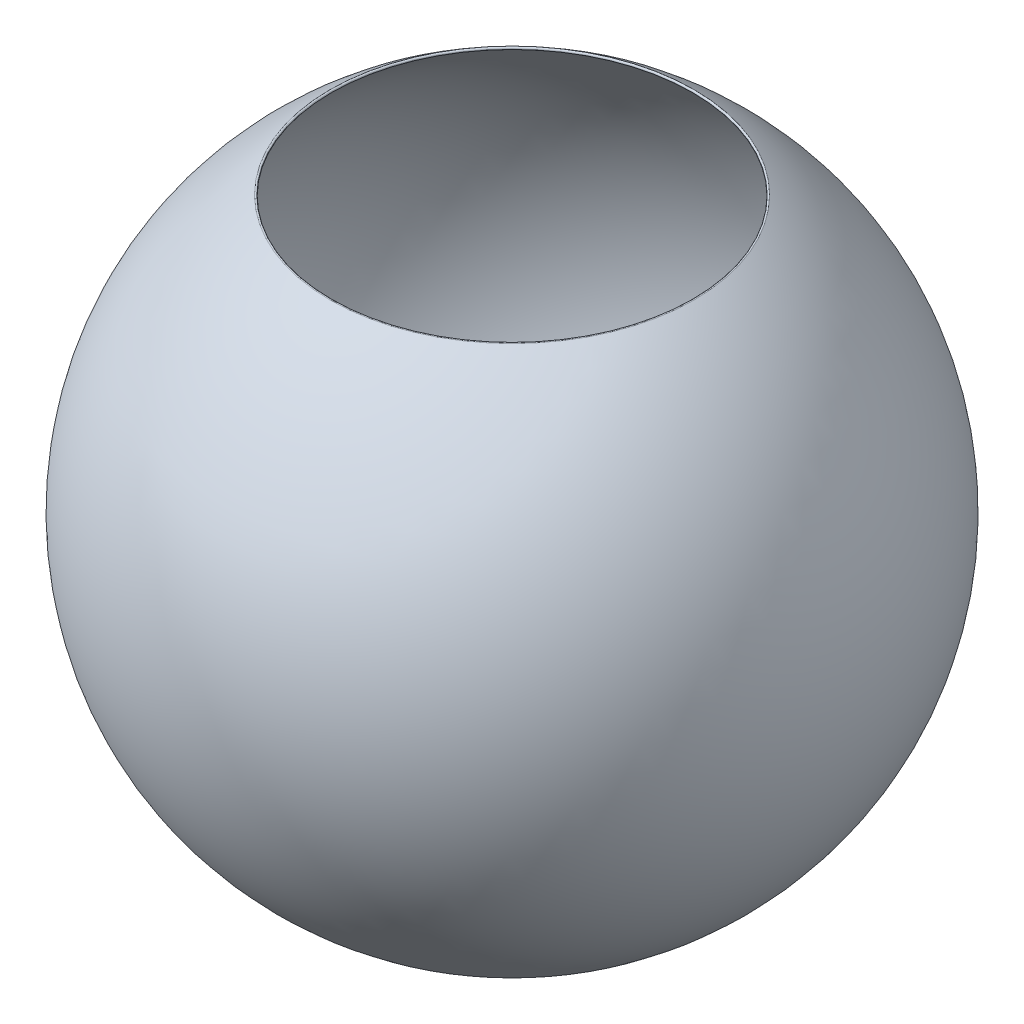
ISO-10303-21;
HEADER;
FILE_DESCRIPTION(('STEP AP214'),'2;1');
FILE_NAME('part.step','',(''),(''),'','','');
FILE_SCHEMA(('AUTOMOTIVE_DESIGN { 1 0 10303 214 1 1 1 1 }'));
ENDSEC;
DATA;
#1=APPLICATION_CONTEXT('core data for automotive mechanical design processes');
#2=APPLICATION_PROTOCOL_DEFINITION('international standard','automotive_design',2000,#1);
#3=PRODUCT_CONTEXT('',#1,'mechanical');
#4=PRODUCT('Part','Part','',(#3));
#5=PRODUCT_RELATED_PRODUCT_CATEGORY('part','',(#4));
#6=PRODUCT_DEFINITION_FORMATION('','',#4);
#7=PRODUCT_DEFINITION_CONTEXT('part definition',#1,'design');
#8=PRODUCT_DEFINITION('design','',#6,#7);
#9=PRODUCT_DEFINITION_SHAPE('','',#8);
#10=(LENGTH_UNIT() NAMED_UNIT(*) SI_UNIT(.MILLI.,.METRE.));
#11=(NAMED_UNIT(*) PLANE_ANGLE_UNIT() SI_UNIT($,.RADIAN.));
#12=(NAMED_UNIT(*) SI_UNIT($,.STERADIAN.) SOLID_ANGLE_UNIT());
#13=UNCERTAINTY_MEASURE_WITH_UNIT(LENGTH_MEASURE(1.E-05),#10,'distance_accuracy_value','');
#14=(GEOMETRIC_REPRESENTATION_CONTEXT(3) GLOBAL_UNCERTAINTY_ASSIGNED_CONTEXT((#13)) GLOBAL_UNIT_ASSIGNED_CONTEXT((#10,
#11,#12)) REPRESENTATION_CONTEXT('',''));
#15=CARTESIAN_POINT('',(0.,0.,0.));
#16=DIRECTION('',(0.,0.,1.));
#17=DIRECTION('',(1.,0.,0.));
#18=AXIS2_PLACEMENT_3D('',#15,#16,#17);
#19=CARTESIAN_POINT('',(0.,158.350876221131,0.));
#20=DIRECTION('',(0.,-1.,0.));
#21=DIRECTION('',(0.,0.,-1.));
#22=AXIS2_PLACEMENT_3D('',#19,#20,#21);
#23=TOROIDAL_SURFACE('',#22,105.,0.700000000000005);
#24=CARTESIAN_POINT('',(0.,158.934274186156,0.));
#25=DIRECTION('',(0.,-1.,0.));
#26=DIRECTION('',(0.,0.,-1.));
#27=AXIS2_PLACEMENT_3D('',#24,#25,#26);
#28=CIRCLE('',#27,105.386842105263);
#29=CARTESIAN_POINT('',(0.,158.934274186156,-105.386842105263));
#30=VERTEX_POINT('',#29);
#31=EDGE_CURVE('E44',#30,#30,#28,.T.);
#32=ORIENTED_EDGE('',*,*,#31,.F.);
#33=EDGE_LOOP('',(#32));
#34=FACE_BOUND('',#33,.T.);
#35=CARTESIAN_POINT('',(0.,157.767478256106,0.));
#36=DIRECTION('',(0.,-1.,0.));
#37=DIRECTION('',(0.,0.,-1.));
#38=AXIS2_PLACEMENT_3D('',#35,#36,#37);
#39=CIRCLE('',#38,104.613157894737);
#40=CARTESIAN_POINT('',(0.,157.767478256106,-104.613157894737));
#41=VERTEX_POINT('',#40);
#42=EDGE_CURVE('E12',#41,#41,#39,.T.);
#43=ORIENTED_EDGE('',*,*,#42,.T.);
#44=EDGE_LOOP('',(#43));
#45=FACE_BOUND('',#44,.T.);
#46=ADVANCED_FACE('F38',(#34,#45),#23,.T.);
#47=CARTESIAN_POINT('',(0.,0.,0.));
#48=DIRECTION('',(0.,-1.,0.));
#49=DIRECTION('',(-1.,0.,0.));
#50=AXIS2_PLACEMENT_3D('',#47,#48,#49);
#51=SPHERICAL_SURFACE('',#50,189.3);
#52=ORIENTED_EDGE('',*,*,#42,.F.);
#53=EDGE_LOOP('',(#52));
#54=FACE_BOUND('',#53,.T.);
#55=ADVANCED_FACE('F53',(#54),#51,.F.);
#56=CARTESIAN_POINT('',(0.,0.,0.));
#57=DIRECTION('',(0.,-1.,0.));
#58=DIRECTION('',(-1.,0.,0.));
#59=AXIS2_PLACEMENT_3D('',#56,#57,#58);
#60=SPHERICAL_SURFACE('',#59,190.7);
#61=ORIENTED_EDGE('',*,*,#31,.T.);
#62=EDGE_LOOP('',(#61));
#63=FACE_BOUND('',#62,.T.);
#64=ADVANCED_FACE('F50',(#63),#60,.T.);
#65=CLOSED_SHELL('',(#46,#55,#64));
#66=MANIFOLD_SOLID_BREP('B2',#65);
#67=ADVANCED_BREP_SHAPE_REPRESENTATION('',(#18,#66),#14);
#68=SHAPE_DEFINITION_REPRESENTATION(#9,#67);
ENDSEC;
END-ISO-10303-21;
